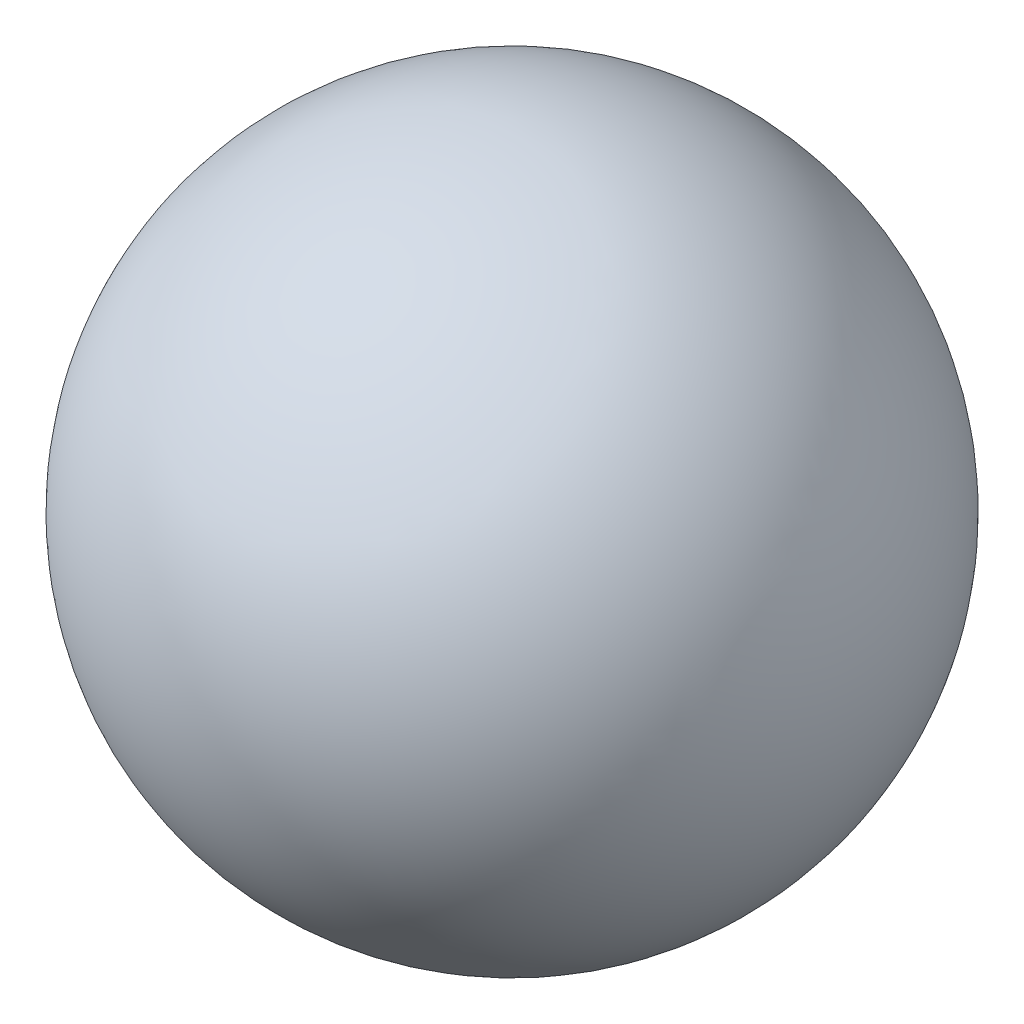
from build123d import *


with BuildPart() as part:
    # Sketch2 → Revolve1 (revolve)
    with BuildSketch(Plane.XY):
        with BuildLine():
            Line((-6.35, 0), (6.35, 0))
            ThreePointArc((6.35, 0), (0, 6.35), (-6.35, 0))
        make_face()
    revolve(axis=Axis((-6.35, 0, 0), (1, 0, 0)))


solid = part.part
